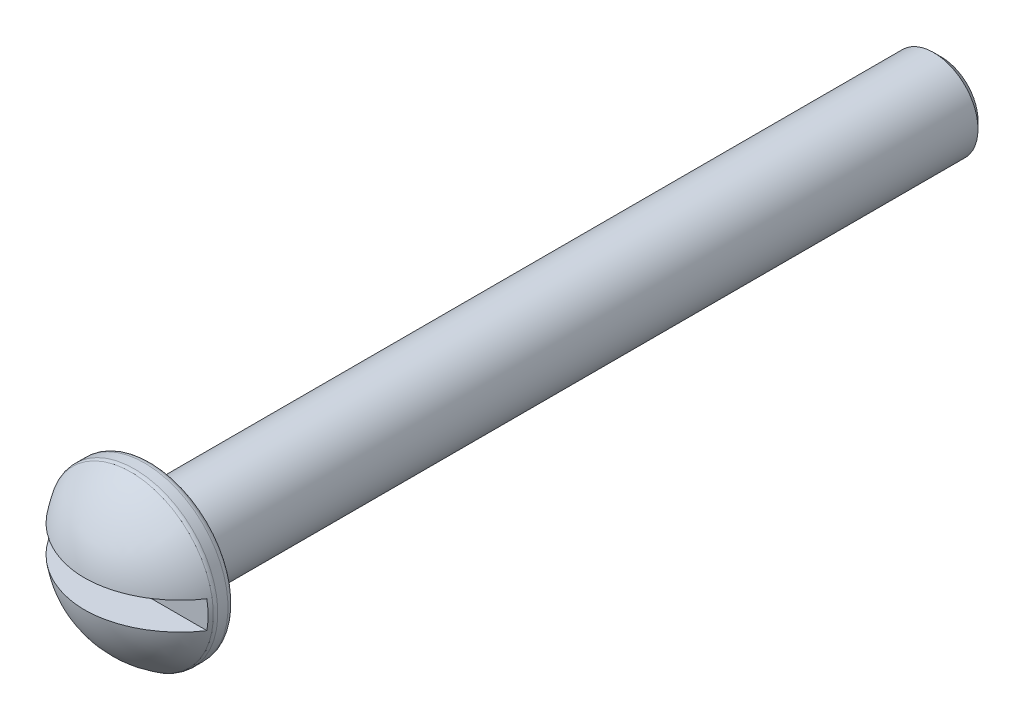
ISO-10303-21;
HEADER;
FILE_DESCRIPTION(('STEP AP214'),'2;1');
FILE_NAME('part.step','',(''),(''),'','','');
FILE_SCHEMA(('AUTOMOTIVE_DESIGN { 1 0 10303 214 1 1 1 1 }'));
ENDSEC;
DATA;
#1=APPLICATION_CONTEXT('core data for automotive mechanical design processes');
#2=APPLICATION_PROTOCOL_DEFINITION('international standard','automotive_design',2000,#1);
#3=PRODUCT_CONTEXT('',#1,'mechanical');
#4=PRODUCT('Part','Part','',(#3));
#5=PRODUCT_RELATED_PRODUCT_CATEGORY('part','',(#4));
#6=PRODUCT_DEFINITION_FORMATION('','',#4);
#7=PRODUCT_DEFINITION_CONTEXT('part definition',#1,'design');
#8=PRODUCT_DEFINITION('design','',#6,#7);
#9=PRODUCT_DEFINITION_SHAPE('','',#8);
#10=(LENGTH_UNIT() NAMED_UNIT(*) SI_UNIT(.MILLI.,.METRE.));
#11=(NAMED_UNIT(*) PLANE_ANGLE_UNIT() SI_UNIT($,.RADIAN.));
#12=(NAMED_UNIT(*) SI_UNIT($,.STERADIAN.) SOLID_ANGLE_UNIT());
#13=UNCERTAINTY_MEASURE_WITH_UNIT(LENGTH_MEASURE(1.E-05),#10,'distance_accuracy_value','');
#14=(GEOMETRIC_REPRESENTATION_CONTEXT(3) GLOBAL_UNCERTAINTY_ASSIGNED_CONTEXT((#13)) GLOBAL_UNIT_ASSIGNED_CONTEXT((#10,
#11,#12)) REPRESENTATION_CONTEXT('',''));
#15=CARTESIAN_POINT('',(0.,0.,0.));
#16=DIRECTION('',(0.,0.,1.));
#17=DIRECTION('',(1.,0.,0.));
#18=AXIS2_PLACEMENT_3D('',#15,#16,#17);
#19=CARTESIAN_POINT('',(0.,0.,29.4840967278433));
#20=DIRECTION('',(0.,0.,1.));
#21=DIRECTION('',(1.,0.,0.));
#22=AXIS2_PLACEMENT_3D('',#19,#20,#21);
#23=CYLINDRICAL_SURFACE('',#22,1.4224);
#24=CARTESIAN_POINT('',(0.,0.,0.243088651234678));
#25=DIRECTION('',(0.,0.,1.));
#26=DIRECTION('',(1.,0.,0.));
#27=AXIS2_PLACEMENT_3D('',#24,#25,#26);
#28=CIRCLE('',#27,1.4224);
#29=CARTESIAN_POINT('',(1.4224,0.,0.243088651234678));
#30=VERTEX_POINT('',#29);
#31=EDGE_CURVE('E136',#30,#30,#28,.T.);
#32=ORIENTED_EDGE('',*,*,#31,.T.);
#33=EDGE_LOOP('',(#32));
#34=FACE_BOUND('',#33,.T.);
#35=CARTESIAN_POINT('',(0.,0.,25.4));
#36=DIRECTION('',(0.,0.,1.));
#37=DIRECTION('',(1.,0.,0.));
#38=AXIS2_PLACEMENT_3D('',#35,#36,#37);
#39=CIRCLE('',#38,1.4224);
#40=CARTESIAN_POINT('',(1.4224,0.,25.4));
#41=VERTEX_POINT('',#40);
#42=EDGE_CURVE('E76',#41,#41,#39,.T.);
#43=ORIENTED_EDGE('',*,*,#42,.F.);
#44=EDGE_LOOP('',(#43));
#45=FACE_BOUND('',#44,.T.);
#46=ADVANCED_FACE('F33',(#34,#45),#23,.T.);
#47=CARTESIAN_POINT('',(0.,1.4224,25.4));
#48=DIRECTION('',(0.,0.,1.));
#49=DIRECTION('',(1.,0.,0.));
#50=AXIS2_PLACEMENT_3D('',#47,#48,#49);
#51=PLANE('',#50);
#52=CARTESIAN_POINT('',(0.,0.,25.4));
#53=DIRECTION('',(0.,0.,-1.));
#54=DIRECTION('',(-1.,0.,0.));
#55=AXIS2_PLACEMENT_3D('',#52,#53,#54);
#56=CIRCLE('',#55,2.46126);
#57=CARTESIAN_POINT('',(-2.46126,0.,25.4));
#58=VERTEX_POINT('',#57);
#59=EDGE_CURVE('E131',#58,#58,#56,.T.);
#60=ORIENTED_EDGE('',*,*,#59,.T.);
#61=EDGE_LOOP('',(#60));
#62=FACE_BOUND('',#61,.T.);
#63=ORIENTED_EDGE('',*,*,#42,.T.);
#64=EDGE_LOOP('',(#63));
#65=FACE_BOUND('',#64,.T.);
#66=ADVANCED_FACE('F99',(#62,#65),#51,.F.);
#67=CARTESIAN_POINT('',(0.,0.,25.61844));
#68=DIRECTION('',(0.,0.,-1.));
#69=DIRECTION('',(-1.,0.,0.));
#70=AXIS2_PLACEMENT_3D('',#67,#68,#69);
#71=TOROIDAL_SURFACE('',#70,2.46126,0.218440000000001);
#72=ORIENTED_EDGE('',*,*,#59,.F.);
#73=EDGE_LOOP('',(#72));
#74=FACE_BOUND('',#73,.T.);
#75=CARTESIAN_POINT('',(0.,0.,25.61844));
#76=DIRECTION('',(0.,0.,-1.));
#77=DIRECTION('',(-1.,0.,0.));
#78=AXIS2_PLACEMENT_3D('',#75,#76,#77);
#79=CIRCLE('',#78,2.6797);
#80=CARTESIAN_POINT('',(-2.6797,0.,25.61844));
#81=VERTEX_POINT('',#80);
#82=EDGE_CURVE('E124',#81,#81,#79,.T.);
#83=ORIENTED_EDGE('',*,*,#82,.T.);
#84=EDGE_LOOP('',(#83));
#85=FACE_BOUND('',#84,.T.);
#86=ADVANCED_FACE('F96',(#74,#85),#71,.T.);
#87=CARTESIAN_POINT('',(0.,0.,29.4840967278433));
#88=DIRECTION('',(0.,0.,1.));
#89=DIRECTION('',(1.,0.,0.));
#90=AXIS2_PLACEMENT_3D('',#87,#88,#89);
#91=CYLINDRICAL_SURFACE('',#90,2.67969999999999);
#92=ORIENTED_EDGE('',*,*,#82,.F.);
#93=EDGE_LOOP('',(#92));
#94=FACE_BOUND('',#93,.T.);
#95=CARTESIAN_POINT('',(0.,0.,25.9461));
#96=DIRECTION('',(0.,0.,-1.));
#97=DIRECTION('',(-1.,0.,0.));
#98=AXIS2_PLACEMENT_3D('',#95,#96,#97);
#99=CIRCLE('',#98,2.6797);
#100=CARTESIAN_POINT('',(-2.6797,0.,25.9461));
#101=VERTEX_POINT('',#100);
#102=EDGE_CURVE('E126',#101,#101,#99,.T.);
#103=ORIENTED_EDGE('',*,*,#102,.T.);
#104=EDGE_LOOP('',(#103));
#105=FACE_BOUND('',#104,.T.);
#106=ADVANCED_FACE('F98',(#94,#105),#91,.T.);
#107=CARTESIAN_POINT('',(0.,0.,24.4187248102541));
#108=DIRECTION('',(0.,0.,-1.));
#109=DIRECTION('',(-1.,0.,0.));
#110=AXIS2_PLACEMENT_3D('',#107,#108,#109);
#111=DEGENERATE_TOROIDAL_SURFACE('',#110,0.0674941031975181,3.1726695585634,.F.);
#112=CARTESIAN_POINT('',(0.,0.4445,27.5498099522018));
#113=CARTESIAN_POINT('',(0.0748535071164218,0.4445,27.5498109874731));
#114=CARTESIAN_POINT('',(0.149707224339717,0.4445,27.5466928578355));
#115=CARTESIAN_POINT('',(0.298991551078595,0.4445,27.5345222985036));
#116=CARTESIAN_POINT('',(0.373421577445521,0.4445,27.5254630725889));
#117=CARTESIAN_POINT('',(0.596709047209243,0.4445,27.4897272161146));
#118=CARTESIAN_POINT('',(0.744279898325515,0.4445,27.4545035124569));
#119=CARTESIAN_POINT('',(1.03281511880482,0.4445,27.3629344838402));
#120=CARTESIAN_POINT('',(1.17377054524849,0.4445,27.3065614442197));
#121=CARTESIAN_POINT('',(1.46569891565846,0.4445,27.1644064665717));
#122=CARTESIAN_POINT('',(1.61519343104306,0.4445,27.0755594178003));
#123=CARTESIAN_POINT('',(1.89743861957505,0.4445,26.8744212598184));
#124=CARTESIAN_POINT('',(2.03018882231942,0.4445,26.7621294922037));
#125=CARTESIAN_POINT('',(2.27739729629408,0.4445,26.5151445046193));
#126=CARTESIAN_POINT('',(2.39151556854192,0.4445,26.3801105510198));
#127=CARTESIAN_POINT('',(2.59551158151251,0.4445,26.0928226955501));
#128=CARTESIAN_POINT('',(2.68538771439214,0.4445,25.9405676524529));
#129=CARTESIAN_POINT('',(2.83849057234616,0.4445,25.6228768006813));
#130=CARTESIAN_POINT('',(2.90167134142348,0.4445,25.4574188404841));
#131=CARTESIAN_POINT('',(2.99936787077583,0.4445,25.1182491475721));
#132=CARTESIAN_POINT('',(3.03388398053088,0.4445,24.9445375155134));
#133=CARTESIAN_POINT('',(3.07328267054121,0.4445,24.5937210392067));
#134=CARTESIAN_POINT('',(3.07815443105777,0.4445,24.4166149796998));
#135=CARTESIAN_POINT('',(3.05809739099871,0.4445,24.0640988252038));
#136=CARTESIAN_POINT('',(3.03316863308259,0.4445,23.8886887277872));
#137=CARTESIAN_POINT('',(2.9542148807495,0.4445,23.5445347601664));
#138=CARTESIAN_POINT('',(2.90018853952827,0.4445,23.375791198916));
#139=CARTESIAN_POINT('',(2.76456977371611,0.4445,23.0497650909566));
#140=CARTESIAN_POINT('',(2.68297632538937,0.4445,22.892482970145));
#141=CARTESIAN_POINT('',(2.49453244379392,0.4445,22.5938582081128));
#142=CARTESIAN_POINT('',(2.38768308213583,0.4445,22.4525148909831));
#143=CARTESIAN_POINT('',(2.15180422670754,0.4445,22.1898178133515));
#144=CARTESIAN_POINT('',(2.02277866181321,0.4445,22.0684605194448));
#145=CARTESIAN_POINT('',(1.74618228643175,0.4445,21.8492059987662));
#146=CARTESIAN_POINT('',(1.59862597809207,0.4445,21.7512905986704));
#147=CARTESIAN_POINT('',(1.36663679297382,0.4445,21.6241126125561));
#148=CARTESIAN_POINT('',(1.28746180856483,0.4445,21.5849784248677));
#149=CARTESIAN_POINT('',(1.12606005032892,0.4445,21.513542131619));
#150=CARTESIAN_POINT('',(1.04383324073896,0.4445,21.4812401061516));
#151=CARTESIAN_POINT('',(0.87705858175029,0.4445,21.4237969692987));
#152=CARTESIAN_POINT('',(0.792514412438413,0.4445,21.3986451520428));
#153=CARTESIAN_POINT('',(0.621566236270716,0.4445,21.3556953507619));
#154=CARTESIAN_POINT('',(0.535162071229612,0.4445,21.337897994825));
#155=CARTESIAN_POINT('',(0.36124003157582,0.4445,21.3100113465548));
#156=CARTESIAN_POINT('',(0.273724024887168,0.4445,21.2999105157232));
#157=CARTESIAN_POINT('',(0.0981418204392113,0.4445,21.2880318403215));
#158=CARTESIAN_POINT('',(0.0100758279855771,0.4445,21.2862510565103));
#159=CARTESIAN_POINT('',(-0.160300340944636,0.4445,21.2911001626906));
#160=CARTESIAN_POINT('',(-0.242625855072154,0.4445,21.2972107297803));
#161=CARTESIAN_POINT('',(-0.406452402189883,0.4445,21.3163888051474));
#162=CARTESIAN_POINT('',(-0.487953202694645,0.4445,21.3294582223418));
#163=CARTESIAN_POINT('',(-0.730618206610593,0.4445,21.3785817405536));
#164=CARTESIAN_POINT('',(-0.8898812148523,0.4445,21.424548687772));
#165=CARTESIAN_POINT('',(-1.20118879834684,0.4445,21.5418894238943));
#166=CARTESIAN_POINT('',(-1.35310209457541,0.4445,21.6136078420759));
#167=CARTESIAN_POINT('',(-1.64344221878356,0.4445,21.7803447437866));
#168=CARTESIAN_POINT('',(-1.78187721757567,0.4445,21.8753489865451));
#169=CARTESIAN_POINT('',(-2.04842164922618,0.4445,22.0915678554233));
#170=CARTESIAN_POINT('',(-2.17565423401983,0.4445,22.2138654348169));
#171=CARTESIAN_POINT('',(-2.40790058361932,0.4445,22.4780686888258));
#172=CARTESIAN_POINT('',(-2.51290597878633,0.4445,22.6199817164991));
#173=CARTESIAN_POINT('',(-2.69796770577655,0.4445,22.9198260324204));
#174=CARTESIAN_POINT('',(-2.77794880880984,0.4445,23.0778037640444));
#175=CARTESIAN_POINT('',(-2.91026260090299,0.4445,23.404924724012));
#176=CARTESIAN_POINT('',(-2.96259765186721,0.4445,23.5740669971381));
#177=CARTESIAN_POINT('',(-3.0381719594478,0.4445,23.918837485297));
#178=CARTESIAN_POINT('',(-3.06139388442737,0.4445,24.0944694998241));
#179=CARTESIAN_POINT('',(-3.07802626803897,0.4445,24.4471414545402));
#180=CARTESIAN_POINT('',(-3.07143635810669,0.4445,24.6241814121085));
#181=CARTESIAN_POINT('',(-3.02862902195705,0.4445,24.9746598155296));
#182=CARTESIAN_POINT('',(-2.99240876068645,0.4445,25.1480979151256));
#183=CARTESIAN_POINT('',(-2.89136148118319,0.4445,25.4864395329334));
#184=CARTESIAN_POINT('',(-2.82653307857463,0.4445,25.6513426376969));
#185=CARTESIAN_POINT('',(-2.67010332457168,0.4445,25.9679279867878));
#186=CARTESIAN_POINT('',(-2.57850097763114,0.4445,26.119609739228));
#187=CARTESIAN_POINT('',(-2.37114686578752,0.4445,26.4054001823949));
#188=CARTESIAN_POINT('',(-2.25540064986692,0.4445,26.5395128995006));
#189=CARTESIAN_POINT('',(-2.00309923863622,0.4445,26.7863089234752));
#190=CARTESIAN_POINT('',(-1.86655783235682,0.4445,26.8990063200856));
#191=CARTESIAN_POINT('',(-1.57637069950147,0.4445,27.0999385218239));
#192=CARTESIAN_POINT('',(-1.42270955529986,0.4445,27.1881510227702));
#193=CARTESIAN_POINT('',(-1.10265377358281,0.4445,27.337402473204));
#194=CARTESIAN_POINT('',(-0.936263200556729,0.4445,27.3984500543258));
#195=CARTESIAN_POINT('',(-0.681093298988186,0.4445,27.4679781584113));
#196=CARTESIAN_POINT('',(-0.59517720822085,0.4445,27.4874734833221));
#197=CARTESIAN_POINT('',(-0.421984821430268,0.4445,27.5188865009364));
#198=CARTESIAN_POINT('',(-0.334709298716,0.4445,27.5308083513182));
#199=CARTESIAN_POINT('',(-0.164926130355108,0.4445,27.5460220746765));
#200=CARTESIAN_POINT('',(-0.0824631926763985,0.4445,27.5498088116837));
#201=CARTESIAN_POINT('',(0.,0.4445,27.5498099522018));
#202=B_SPLINE_CURVE_WITH_KNOTS('',3,(#112,#113,#114,#115,#116,#117,#118,#119,#120,#121,#122,
#123,#124,#125,#126,#127,#128,#129,#130,#131,#132,#133,#134,#135,#136,#137,#138,#139,#140,#141,
#142,#143,#144,#145,#146,#147,#148,#149,#150,#151,#152,#153,#154,#155,#156,#157,#158,#159,#160,
#161,#162,#163,#164,#165,#166,#167,#168,#169,#170,#171,#172,#173,#174,#175,#176,#177,#178,#179,
#180,#181,#182,#183,#184,#185,#186,#187,#188,#189,#190,#191,#192,#193,#194,#195,#196,#197,#198,
#199,#200,#201),.UNSPECIFIED.,.T.,.F.,(4,2,2,2,2,2,2,2,2,2,2,2,2,2,2,2,2,2,2,2,2,2,2,2,2,2,2,2,
2,2,2,2,2,2,2,2,2,2,2,2,2,2,2,2,4),(0.,0.224495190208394,0.449247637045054,0.90256490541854,
1.35647829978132,1.87572700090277,2.39499028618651,2.92286813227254,3.45078098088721,
3.97959896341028,4.50841049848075,5.03741503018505,5.56641880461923,6.09544706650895,
6.62449497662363,7.15352044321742,7.68245228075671,8.21097272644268,8.4756684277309,
8.74036723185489,9.00466759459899,9.26899052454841,9.53291640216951,9.79674903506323,
10.0440724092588,10.2914636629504,10.7864354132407,11.2882945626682,11.7898475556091,
12.3167777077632,12.8439059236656,13.3726039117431,13.9012567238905,14.4302241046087,
14.959198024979,15.4882225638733,16.0172727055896,16.5463425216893,17.0752908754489,
17.6038900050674,18.1329690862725,18.6618799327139,18.9259117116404,19.1897984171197,
19.4371160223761),.UNSPECIFIED.);
#203=CARTESIAN_POINT('',(-2.54479274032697,0.4445,26.162));
#204=VERTEX_POINT('',#203);
#205=CARTESIAN_POINT('',(2.54479274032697,0.4445,26.162));
#206=VERTEX_POINT('',#205);
#207=EDGE_CURVE('E37',#204,#206,#202,.T.);
#208=ORIENTED_EDGE('',*,*,#207,.T.);
#209=CARTESIAN_POINT('',(0.,0.,26.162));
#210=DIRECTION('',(0.,0.,-1.));
#211=DIRECTION('',(-1.,0.,0.));
#212=AXIS2_PLACEMENT_3D('',#209,#210,#211);
#213=CIRCLE('',#212,2.58332157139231);
#214=CARTESIAN_POINT('',(2.54479274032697,-0.4445,26.162));
#215=VERTEX_POINT('',#214);
#216=EDGE_CURVE('E11',#206,#215,#213,.T.);
#217=ORIENTED_EDGE('',*,*,#216,.T.);
#218=CARTESIAN_POINT('',(0.,-0.4445,27.5498099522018));
#219=CARTESIAN_POINT('',(-0.0748535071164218,-0.4445,27.5498109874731));
#220=CARTESIAN_POINT('',(-0.149707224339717,-0.4445,27.5466928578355));
#221=CARTESIAN_POINT('',(-0.298991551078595,-0.4445,27.5345222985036));
#222=CARTESIAN_POINT('',(-0.373421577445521,-0.4445,27.5254630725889));
#223=CARTESIAN_POINT('',(-0.596709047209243,-0.4445,27.4897272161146));
#224=CARTESIAN_POINT('',(-0.744279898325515,-0.4445,27.4545035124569));
#225=CARTESIAN_POINT('',(-1.03281511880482,-0.4445,27.3629344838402));
#226=CARTESIAN_POINT('',(-1.17377054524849,-0.4445,27.3065614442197));
#227=CARTESIAN_POINT('',(-1.46569891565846,-0.4445,27.1644064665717));
#228=CARTESIAN_POINT('',(-1.61519343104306,-0.4445,27.0755594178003));
#229=CARTESIAN_POINT('',(-1.89743861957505,-0.4445,26.8744212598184));
#230=CARTESIAN_POINT('',(-2.03018882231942,-0.4445,26.7621294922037));
#231=CARTESIAN_POINT('',(-2.27739729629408,-0.4445,26.5151445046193));
#232=CARTESIAN_POINT('',(-2.39151556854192,-0.4445,26.3801105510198));
#233=CARTESIAN_POINT('',(-2.59551158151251,-0.4445,26.0928226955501));
#234=CARTESIAN_POINT('',(-2.68538771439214,-0.4445,25.9405676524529));
#235=CARTESIAN_POINT('',(-2.83849057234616,-0.4445,25.6228768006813));
#236=CARTESIAN_POINT('',(-2.90167134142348,-0.4445,25.4574188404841));
#237=CARTESIAN_POINT('',(-2.99936787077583,-0.4445,25.1182491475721));
#238=CARTESIAN_POINT('',(-3.03388398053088,-0.4445,24.9445375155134));
#239=CARTESIAN_POINT('',(-3.07328267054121,-0.4445,24.5937210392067));
#240=CARTESIAN_POINT('',(-3.07815443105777,-0.4445,24.4166149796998));
#241=CARTESIAN_POINT('',(-3.05809739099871,-0.4445,24.0640988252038));
#242=CARTESIAN_POINT('',(-3.03316863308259,-0.4445,23.8886887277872));
#243=CARTESIAN_POINT('',(-2.9542148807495,-0.4445,23.5445347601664));
#244=CARTESIAN_POINT('',(-2.90018853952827,-0.4445,23.375791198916));
#245=CARTESIAN_POINT('',(-2.76456977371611,-0.4445,23.0497650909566));
#246=CARTESIAN_POINT('',(-2.68297632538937,-0.4445,22.892482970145));
#247=CARTESIAN_POINT('',(-2.49453244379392,-0.4445,22.5938582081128));
#248=CARTESIAN_POINT('',(-2.38768308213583,-0.4445,22.4525148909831));
#249=CARTESIAN_POINT('',(-2.15180422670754,-0.4445,22.1898178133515));
#250=CARTESIAN_POINT('',(-2.02277866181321,-0.4445,22.0684605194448));
#251=CARTESIAN_POINT('',(-1.74618228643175,-0.4445,21.8492059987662));
#252=CARTESIAN_POINT('',(-1.59862597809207,-0.4445,21.7512905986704));
#253=CARTESIAN_POINT('',(-1.36663679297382,-0.4445,21.6241126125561));
#254=CARTESIAN_POINT('',(-1.28746180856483,-0.4445,21.5849784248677));
#255=CARTESIAN_POINT('',(-1.12606005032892,-0.4445,21.513542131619));
#256=CARTESIAN_POINT('',(-1.04383324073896,-0.4445,21.4812401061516));
#257=CARTESIAN_POINT('',(-0.87705858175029,-0.4445,21.4237969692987));
#258=CARTESIAN_POINT('',(-0.792514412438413,-0.4445,21.3986451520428));
#259=CARTESIAN_POINT('',(-0.621566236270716,-0.4445,21.3556953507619));
#260=CARTESIAN_POINT('',(-0.535162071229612,-0.4445,21.337897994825));
#261=CARTESIAN_POINT('',(-0.36124003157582,-0.4445,21.3100113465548));
#262=CARTESIAN_POINT('',(-0.273724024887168,-0.4445,21.2999105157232));
#263=CARTESIAN_POINT('',(-0.0981418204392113,-0.4445,21.2880318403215));
#264=CARTESIAN_POINT('',(-0.0100758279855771,-0.4445,21.2862510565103));
#265=CARTESIAN_POINT('',(0.160300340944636,-0.4445,21.2911001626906));
#266=CARTESIAN_POINT('',(0.242625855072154,-0.4445,21.2972107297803));
#267=CARTESIAN_POINT('',(0.406452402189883,-0.4445,21.3163888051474));
#268=CARTESIAN_POINT('',(0.487953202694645,-0.4445,21.3294582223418));
#269=CARTESIAN_POINT('',(0.730618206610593,-0.4445,21.3785817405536));
#270=CARTESIAN_POINT('',(0.8898812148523,-0.4445,21.424548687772));
#271=CARTESIAN_POINT('',(1.20118879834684,-0.4445,21.5418894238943));
#272=CARTESIAN_POINT('',(1.35310209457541,-0.4445,21.6136078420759));
#273=CARTESIAN_POINT('',(1.64344221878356,-0.4445,21.7803447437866));
#274=CARTESIAN_POINT('',(1.78187721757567,-0.4445,21.8753489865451));
#275=CARTESIAN_POINT('',(2.04842164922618,-0.4445,22.0915678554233));
#276=CARTESIAN_POINT('',(2.17565423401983,-0.4445,22.2138654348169));
#277=CARTESIAN_POINT('',(2.40790058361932,-0.4445,22.4780686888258));
#278=CARTESIAN_POINT('',(2.51290597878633,-0.4445,22.6199817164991));
#279=CARTESIAN_POINT('',(2.69796770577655,-0.4445,22.9198260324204));
#280=CARTESIAN_POINT('',(2.77794880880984,-0.4445,23.0778037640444));
#281=CARTESIAN_POINT('',(2.91026260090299,-0.4445,23.404924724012));
#282=CARTESIAN_POINT('',(2.96259765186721,-0.4445,23.5740669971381));
#283=CARTESIAN_POINT('',(3.0381719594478,-0.4445,23.918837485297));
#284=CARTESIAN_POINT('',(3.06139388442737,-0.4445,24.0944694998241));
#285=CARTESIAN_POINT('',(3.07802626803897,-0.4445,24.4471414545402));
#286=CARTESIAN_POINT('',(3.07143635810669,-0.4445,24.6241814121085));
#287=CARTESIAN_POINT('',(3.02862902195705,-0.4445,24.9746598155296));
#288=CARTESIAN_POINT('',(2.99240876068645,-0.4445,25.1480979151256));
#289=CARTESIAN_POINT('',(2.89136148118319,-0.4445,25.4864395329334));
#290=CARTESIAN_POINT('',(2.82653307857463,-0.4445,25.6513426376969));
#291=CARTESIAN_POINT('',(2.67010332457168,-0.4445,25.9679279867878));
#292=CARTESIAN_POINT('',(2.57850097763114,-0.4445,26.119609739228));
#293=CARTESIAN_POINT('',(2.37114686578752,-0.4445,26.4054001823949));
#294=CARTESIAN_POINT('',(2.25540064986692,-0.4445,26.5395128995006));
#295=CARTESIAN_POINT('',(2.00309923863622,-0.4445,26.7863089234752));
#296=CARTESIAN_POINT('',(1.86655783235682,-0.4445,26.8990063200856));
#297=CARTESIAN_POINT('',(1.57637069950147,-0.4445,27.0999385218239));
#298=CARTESIAN_POINT('',(1.42270955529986,-0.4445,27.1881510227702));
#299=CARTESIAN_POINT('',(1.10265377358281,-0.4445,27.337402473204));
#300=CARTESIAN_POINT('',(0.936263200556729,-0.4445,27.3984500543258));
#301=CARTESIAN_POINT('',(0.681093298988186,-0.4445,27.4679781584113));
#302=CARTESIAN_POINT('',(0.59517720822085,-0.4445,27.4874734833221));
#303=CARTESIAN_POINT('',(0.421984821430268,-0.4445,27.5188865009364));
#304=CARTESIAN_POINT('',(0.334709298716,-0.4445,27.5308083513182));
#305=CARTESIAN_POINT('',(0.164926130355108,-0.4445,27.5460220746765));
#306=CARTESIAN_POINT('',(0.0824631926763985,-0.4445,27.5498088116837));
#307=CARTESIAN_POINT('',(0.,-0.4445,27.5498099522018));
#308=B_SPLINE_CURVE_WITH_KNOTS('',3,(#218,#219,#220,#221,#222,#223,#224,#225,#226,#227,#228,
#229,#230,#231,#232,#233,#234,#235,#236,#237,#238,#239,#240,#241,#242,#243,#244,#245,#246,#247,
#248,#249,#250,#251,#252,#253,#254,#255,#256,#257,#258,#259,#260,#261,#262,#263,#264,#265,#266,
#267,#268,#269,#270,#271,#272,#273,#274,#275,#276,#277,#278,#279,#280,#281,#282,#283,#284,#285,
#286,#287,#288,#289,#290,#291,#292,#293,#294,#295,#296,#297,#298,#299,#300,#301,#302,#303,#304,
#305,#306,#307),.UNSPECIFIED.,.T.,.F.,(4,2,2,2,2,2,2,2,2,2,2,2,2,2,2,2,2,2,2,2,2,2,2,2,2,2,2,2,
2,2,2,2,2,2,2,2,2,2,2,2,2,2,2,2,4),(0.,0.224495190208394,0.449247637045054,0.90256490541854,
1.35647829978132,1.87572700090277,2.39499028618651,2.92286813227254,3.45078098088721,
3.97959896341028,4.50841049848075,5.03741503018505,5.56641880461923,6.09544706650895,
6.62449497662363,7.15352044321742,7.68245228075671,8.21097272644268,8.4756684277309,
8.74036723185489,9.00466759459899,9.26899052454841,9.53291640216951,9.79674903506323,
10.0440724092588,10.2914636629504,10.7864354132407,11.2882945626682,11.7898475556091,
12.3167777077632,12.8439059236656,13.3726039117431,13.9012567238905,14.4302241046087,
14.959198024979,15.4882225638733,16.0172727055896,16.5463425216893,17.0752908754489,
17.6038900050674,18.1329690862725,18.6618799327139,18.9259117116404,19.1897984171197,
19.4371160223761),.UNSPECIFIED.);
#309=CARTESIAN_POINT('',(-2.54479274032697,-0.4445,26.162));
#310=VERTEX_POINT('',#309);
#311=EDGE_CURVE('E61',#215,#310,#308,.T.);
#312=ORIENTED_EDGE('',*,*,#311,.T.);
#313=EDGE_CURVE('E47',#310,#204,#213,.T.);
#314=ORIENTED_EDGE('',*,*,#313,.T.);
#315=EDGE_LOOP('',(#208,#217,#312,#314));
#316=FACE_BOUND('',#315,.T.);
#317=CARTESIAN_POINT('',(0.,0.,26.0590363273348));
#318=DIRECTION('',(0.,0.,-1.));
#319=DIRECTION('',(-1.,0.,0.));
#320=AXIS2_PLACEMENT_3D('',#317,#318,#319);
#321=CIRCLE('',#320,2.64823973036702);
#322=CARTESIAN_POINT('',(-2.64823973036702,0.,26.0590363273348));
#323=VERTEX_POINT('',#322);
#324=EDGE_CURVE('E127',#323,#323,#321,.T.);
#325=ORIENTED_EDGE('',*,*,#324,.F.);
#326=EDGE_LOOP('',(#325));
#327=FACE_BOUND('',#326,.T.);
#328=ADVANCED_FACE('F74',(#316,#327),#111,.F.);
#329=CARTESIAN_POINT('',(0.,0.,25.9461));
#330=DIRECTION('',(0.,0.,-1.));
#331=DIRECTION('',(-1.,0.,0.));
#332=AXIS2_PLACEMENT_3D('',#329,#330,#331);
#333=TOROIDAL_SURFACE('',#332,2.46126,0.218439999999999);
#334=ORIENTED_EDGE('',*,*,#102,.F.);
#335=EDGE_LOOP('',(#334));
#336=FACE_BOUND('',#335,.T.);
#337=ORIENTED_EDGE('',*,*,#324,.T.);
#338=EDGE_LOOP('',(#337));
#339=FACE_BOUND('',#338,.T.);
#340=ADVANCED_FACE('F94',(#336,#339),#333,.T.);
#341=CARTESIAN_POINT('',(0.,0.,0.433685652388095));
#342=DIRECTION('',(0.,0.,1.));
#343=DIRECTION('',(1.,0.,0.));
#344=AXIS2_PLACEMENT_3D('',#341,#342,#343);
#345=CONICAL_SURFACE('',#344,1.61299700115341,0.785398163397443);
#346=CARTESIAN_POINT('',(0.,0.,0.));
#347=DIRECTION('',(0.,0.,-1.));
#348=DIRECTION('',(-1.,0.,0.));
#349=AXIS2_PLACEMENT_3D('',#346,#347,#348);
#350=CIRCLE('',#349,1.17931134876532);
#351=CARTESIAN_POINT('',(-1.17931134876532,0.,0.));
#352=VERTEX_POINT('',#351);
#353=EDGE_CURVE('E137',#352,#352,#350,.T.);
#354=ORIENTED_EDGE('',*,*,#353,.F.);
#355=EDGE_LOOP('',(#354));
#356=FACE_BOUND('',#355,.T.);
#357=ORIENTED_EDGE('',*,*,#31,.F.);
#358=EDGE_LOOP('',(#357));
#359=FACE_BOUND('',#358,.T.);
#360=ADVANCED_FACE('F91',(#356,#359),#345,.T.);
#361=CARTESIAN_POINT('',(0.,0.,0.));
#362=DIRECTION('',(0.,0.,1.));
#363=DIRECTION('',(1.,0.,0.));
#364=AXIS2_PLACEMENT_3D('',#361,#362,#363);
#365=PLANE('',#364);
#366=ORIENTED_EDGE('',*,*,#353,.T.);
#367=EDGE_LOOP('',(#366));
#368=FACE_BOUND('',#367,.T.);
#369=ADVANCED_FACE('F35',(#368),#365,.F.);
#370=CARTESIAN_POINT('',(-3.16796405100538,0.4445,26.162));
#371=DIRECTION('',(0.,1.,0.));
#372=DIRECTION('',(0.,0.,1.));
#373=AXIS2_PLACEMENT_3D('',#370,#371,#372);
#374=PLANE('',#373);
#375=DIRECTION('',(-1.,0.,0.));
#376=VECTOR('',#375,1.);
#377=CARTESIAN_POINT('',(-3.16796405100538,0.4445,26.162));
#378=LINE('',#377,#376);
#379=EDGE_CURVE('E54',#206,#204,#378,.T.);
#380=ORIENTED_EDGE('',*,*,#379,.F.);
#381=ORIENTED_EDGE('',*,*,#207,.F.);
#382=EDGE_LOOP('',(#380,#381));
#383=FACE_BOUND('',#382,.T.);
#384=ADVANCED_FACE('F71',(#383),#374,.F.);
#385=CARTESIAN_POINT('',(3.16796405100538,-0.4445,26.162));
#386=DIRECTION('',(0.,-1.,0.));
#387=DIRECTION('',(0.,0.,-1.));
#388=AXIS2_PLACEMENT_3D('',#385,#386,#387);
#389=PLANE('',#388);
#390=DIRECTION('',(1.,0.,0.));
#391=VECTOR('',#390,1.);
#392=CARTESIAN_POINT('',(3.16796405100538,-0.4445,26.162));
#393=LINE('',#392,#391);
#394=EDGE_CURVE('E67',#310,#215,#393,.T.);
#395=ORIENTED_EDGE('',*,*,#394,.F.);
#396=ORIENTED_EDGE('',*,*,#311,.F.);
#397=EDGE_LOOP('',(#395,#396));
#398=FACE_BOUND('',#397,.T.);
#399=ADVANCED_FACE('F84',(#398),#389,.F.);
#400=CARTESIAN_POINT('',(3.16796405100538,0.4445,26.162));
#401=DIRECTION('',(0.,0.,-1.));
#402=DIRECTION('',(-1.,0.,0.));
#403=AXIS2_PLACEMENT_3D('',#400,#401,#402);
#404=PLANE('',#403);
#405=ORIENTED_EDGE('',*,*,#379,.T.);
#406=ORIENTED_EDGE('',*,*,#313,.F.);
#407=ORIENTED_EDGE('',*,*,#394,.T.);
#408=ORIENTED_EDGE('',*,*,#216,.F.);
#409=EDGE_LOOP('',(#405,#406,#407,#408));
#410=FACE_BOUND('',#409,.T.);
#411=ADVANCED_FACE('F66',(#410),#404,.F.);
#412=CLOSED_SHELL('',(#46,#66,#86,#106,#328,#340,#360,#369,#384,#399,#411));
#413=MANIFOLD_SOLID_BREP('B2',#412);
#414=ADVANCED_BREP_SHAPE_REPRESENTATION('',(#18,#413),#14);
#415=SHAPE_DEFINITION_REPRESENTATION(#9,#414);
ENDSEC;
END-ISO-10303-21;
